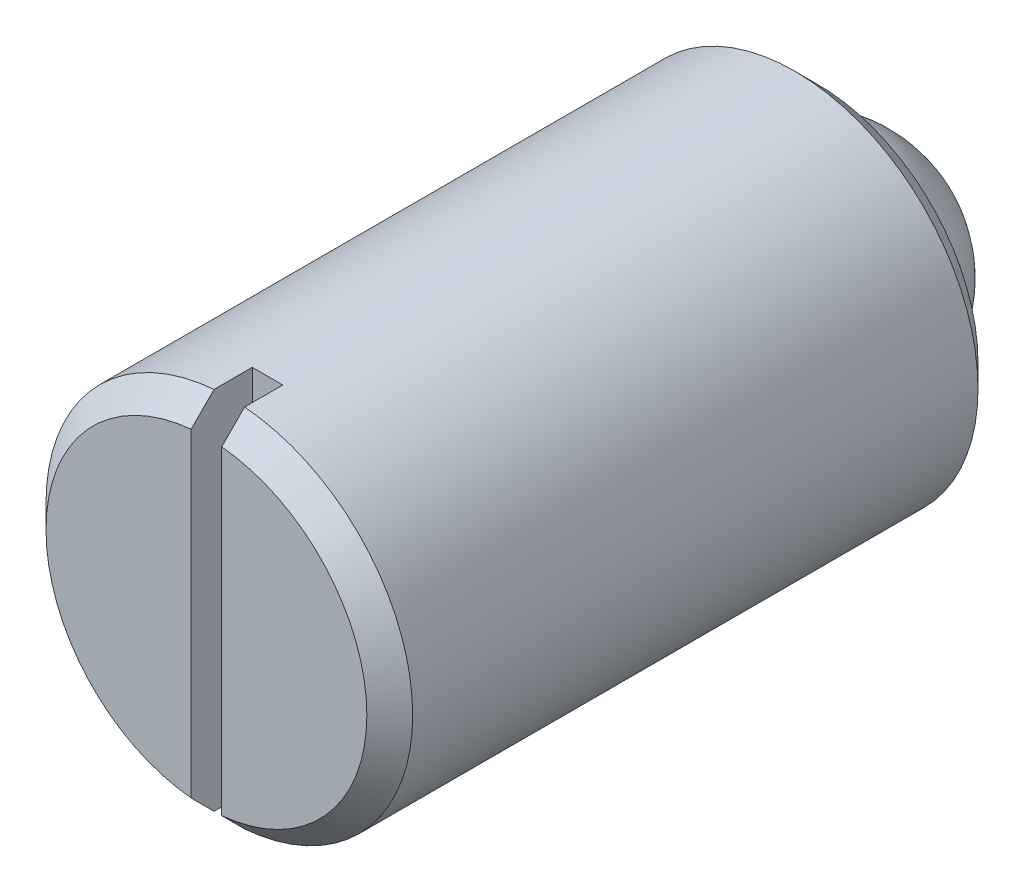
ISO-10303-21;
HEADER;
FILE_DESCRIPTION(('STEP AP214'),'2;1');
FILE_NAME('part.step','',(''),(''),'','','');
FILE_SCHEMA(('AUTOMOTIVE_DESIGN { 1 0 10303 214 1 1 1 1 }'));
ENDSEC;
DATA;
#1=APPLICATION_CONTEXT('core data for automotive mechanical design processes');
#2=APPLICATION_PROTOCOL_DEFINITION('international standard','automotive_design',2000,#1);
#3=PRODUCT_CONTEXT('',#1,'mechanical');
#4=PRODUCT('Part','Part','',(#3));
#5=PRODUCT_RELATED_PRODUCT_CATEGORY('part','',(#4));
#6=PRODUCT_DEFINITION_FORMATION('','',#4);
#7=PRODUCT_DEFINITION_CONTEXT('part definition',#1,'design');
#8=PRODUCT_DEFINITION('design','',#6,#7);
#9=PRODUCT_DEFINITION_SHAPE('','',#8);
#10=(LENGTH_UNIT() NAMED_UNIT(*) SI_UNIT(.MILLI.,.METRE.));
#11=(NAMED_UNIT(*) PLANE_ANGLE_UNIT() SI_UNIT($,.RADIAN.));
#12=(NAMED_UNIT(*) SI_UNIT($,.STERADIAN.) SOLID_ANGLE_UNIT());
#13=UNCERTAINTY_MEASURE_WITH_UNIT(LENGTH_MEASURE(1.E-05),#10,'distance_accuracy_value','');
#14=(GEOMETRIC_REPRESENTATION_CONTEXT(3) GLOBAL_UNCERTAINTY_ASSIGNED_CONTEXT((#13)) GLOBAL_UNIT_ASSIGNED_CONTEXT((#10,
#11,#12)) REPRESENTATION_CONTEXT('',''));
#15=CARTESIAN_POINT('',(0.,0.,0.));
#16=DIRECTION('',(0.,0.,1.));
#17=DIRECTION('',(1.,0.,0.));
#18=AXIS2_PLACEMENT_3D('',#15,#16,#17);
#19=CARTESIAN_POINT('',(0.,0.,0.));
#20=DIRECTION('',(0.,0.,1.));
#21=DIRECTION('',(1.,0.,0.));
#22=AXIS2_PLACEMENT_3D('',#19,#20,#21);
#23=PLANE('',#22);
#24=CARTESIAN_POINT('',(0.,0.,0.));
#25=DIRECTION('',(0.,0.,1.));
#26=DIRECTION('',(1.,0.,0.));
#27=AXIS2_PLACEMENT_3D('',#24,#25,#26);
#28=CIRCLE('',#27,5.25);
#29=CARTESIAN_POINT('',(5.25,0.,0.));
#30=VERTEX_POINT('',#29);
#31=EDGE_CURVE('E110',#30,#30,#28,.F.);
#32=ORIENTED_EDGE('',*,*,#31,.T.);
#33=EDGE_LOOP('',(#32));
#34=FACE_BOUND('',#33,.T.);
#35=CARTESIAN_POINT('',(0.,0.,0.));
#36=DIRECTION('',(0.,0.,1.));
#37=DIRECTION('',(1.,0.,0.));
#38=AXIS2_PLACEMENT_3D('',#35,#36,#37);
#39=CIRCLE('',#38,3.96862696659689);
#40=CARTESIAN_POINT('',(3.96862696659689,0.,0.));
#41=VERTEX_POINT('',#40);
#42=EDGE_CURVE('E11',#41,#41,#39,.F.);
#43=ORIENTED_EDGE('',*,*,#42,.F.);
#44=EDGE_LOOP('',(#43));
#45=FACE_BOUND('',#44,.T.);
#46=ADVANCED_FACE('F32',(#34,#45),#23,.F.);
#47=CARTESIAN_POINT('',(0.,0.,20.));
#48=DIRECTION('',(0.,0.,1.));
#49=DIRECTION('',(1.,0.,0.));
#50=AXIS2_PLACEMENT_3D('',#47,#48,#49);
#51=PLANE('',#50);
#52=DIRECTION('',(0.,-1.,0.));
#53=VECTOR('',#52,1.);
#54=CARTESIAN_POINT('',(-0.5,-5.9791303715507,20.));
#55=LINE('',#54,#53);
#56=CARTESIAN_POINT('',(-0.5,5.22613624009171,20.));
#57=VERTEX_POINT('',#56);
#58=CARTESIAN_POINT('',(-0.5,-5.22613624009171,20.));
#59=VERTEX_POINT('',#58);
#60=EDGE_CURVE('E84',#57,#59,#55,.T.);
#61=ORIENTED_EDGE('',*,*,#60,.F.);
#62=CARTESIAN_POINT('',(0.,0.,20.));
#63=DIRECTION('',(0.,0.,1.));
#64=DIRECTION('',(1.,0.,0.));
#65=AXIS2_PLACEMENT_3D('',#62,#63,#64);
#66=CIRCLE('',#65,5.25);
#67=EDGE_CURVE('E96',#57,#59,#66,.T.);
#68=ORIENTED_EDGE('',*,*,#67,.T.);
#69=EDGE_LOOP('',(#61,#68));
#70=FACE_BOUND('',#69,.T.);
#71=ADVANCED_FACE('F95',(#70),#51,.T.);
#72=CARTESIAN_POINT('',(0.,0.,20.));
#73=DIRECTION('',(0.,0.,-1.));
#74=DIRECTION('',(-1.,0.,0.));
#75=AXIS2_PLACEMENT_3D('',#72,#73,#74);
#76=CONICAL_SURFACE('',#75,5.25,0.785398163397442);
#77=CARTESIAN_POINT('',(-0.5,9.92785552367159,15.3095616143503));
#78=CARTESIAN_POINT('',(-0.5,9.55208986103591,15.684845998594));
#79=CARTESIAN_POINT('',(-0.5,9.17630246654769,16.0601086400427));
#80=CARTESIAN_POINT('',(-0.5,8.42465346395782,16.8105507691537));
#81=CARTESIAN_POINT('',(-0.5,8.04879185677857,17.1857302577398));
#82=CARTESIAN_POINT('',(-0.5,7.29696704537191,17.9359630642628));
#83=CARTESIAN_POINT('',(-0.5,6.92100384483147,18.3110163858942));
#84=CARTESIAN_POINT('',(-0.5,6.16889213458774,19.0609458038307));
#85=CARTESIAN_POINT('',(-0.5,5.79274362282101,19.4358218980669));
#86=CARTESIAN_POINT('',(-0.5,5.22826724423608,19.9979065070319));
#87=CARTESIAN_POINT('',(-0.5,5.04005989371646,20.1852360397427));
#88=CARTESIAN_POINT('',(-0.5,4.66353260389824,20.559780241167));
#89=CARTESIAN_POINT('',(-0.5,4.47521266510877,20.7469949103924));
#90=CARTESIAN_POINT('',(-0.5,4.09841687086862,21.1212541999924));
#91=CARTESIAN_POINT('',(-0.5,3.90994102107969,21.3082988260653));
#92=CARTESIAN_POINT('',(-0.5,3.53273897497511,21.6821415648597));
#93=CARTESIAN_POINT('',(-0.5,3.34401277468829,21.8689396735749));
#94=CARTESIAN_POINT('',(-0.5,2.96614271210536,22.2421588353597));
#95=CARTESIAN_POINT('',(-0.5,2.77699880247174,22.4285798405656));
#96=CARTESIAN_POINT('',(-0.5,2.49275132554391,22.707659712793));
#97=CARTESIAN_POINT('',(-0.5,2.39791616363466,22.8005918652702));
#98=CARTESIAN_POINT('',(-0.5,2.20798895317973,22.9861967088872));
#99=CARTESIAN_POINT('',(-0.5,2.11289690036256,23.0788693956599));
#100=CARTESIAN_POINT('',(-0.5,1.92232227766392,23.2638485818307));
#101=CARTESIAN_POINT('',(-0.5,1.82683963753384,23.3561550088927));
#102=CARTESIAN_POINT('',(-0.5,1.63530782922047,23.5401711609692));
#103=CARTESIAN_POINT('',(-0.5,1.53925868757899,23.6318809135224));
#104=CARTESIAN_POINT('',(-0.5,1.39445591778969,23.7686960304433));
#105=CARTESIAN_POINT('',(-0.5,1.34606145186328,23.814181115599));
#106=CARTESIAN_POINT('',(-0.5,1.24894665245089,23.9047998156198));
#107=CARTESIAN_POINT('',(-0.5,1.20022632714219,23.9499334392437));
#108=CARTESIAN_POINT('',(-0.5,1.10233613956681,24.0397291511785));
#109=CARTESIAN_POINT('',(-0.5,1.05316620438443,24.0843911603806));
#110=CARTESIAN_POINT('',(-0.5,0.954163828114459,24.1729822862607));
#111=CARTESIAN_POINT('',(-0.5,0.904331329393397,24.2169113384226));
#112=CARTESIAN_POINT('',(-0.5,0.854061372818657,24.2603430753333));
#113=B_SPLINE_CURVE_WITH_KNOTS('',3,(#77,#78,#79,#80,#81,#82,#83,#84,#85,#86,#87,#88,#89,#90,
#91,#92,#93,#94,#95,#96,#97,#98,#99,#100,#101,#102,#103,#104,#105,#106,#107,#108,#109,#110,#111,
#112),.UNSPECIFIED.,.F.,.F.,(4,2,2,2,2,2,2,2,2,2,2,2,2,2,2,2,2,4),(0.,1.59321808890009,
3.18641748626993,4.77956525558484,6.37273118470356,7.16936735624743,7.96599995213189,
8.76260478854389,9.55922241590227,10.355935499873,10.75427026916,11.1526117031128,
11.5510282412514,11.9494262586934,12.1486691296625,12.3479070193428,12.5471778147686,
12.7464660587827),.UNSPECIFIED.);
#114=CARTESIAN_POINT('',(-0.5,5.9791303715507,19.25));
#115=VERTEX_POINT('',#114);
#116=EDGE_CURVE('E81',#115,#57,#113,.T.);
#117=ORIENTED_EDGE('',*,*,#116,.F.);
#118=CARTESIAN_POINT('',(0.,0.,19.25));
#119=DIRECTION('',(0.,0.,1.));
#120=DIRECTION('',(1.,0.,0.));
#121=AXIS2_PLACEMENT_3D('',#118,#119,#120);
#122=CIRCLE('',#121,6.);
#123=CARTESIAN_POINT('',(-0.5,-5.9791303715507,19.25));
#124=VERTEX_POINT('',#123);
#125=EDGE_CURVE('E119',#124,#115,#122,.F.);
#126=ORIENTED_EDGE('',*,*,#125,.F.);
#127=CARTESIAN_POINT('',(-0.5,-0.854061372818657,24.2603430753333));
#128=CARTESIAN_POINT('',(-0.5,-0.890663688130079,24.2287410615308));
#129=CARTESIAN_POINT('',(-0.5,-0.927023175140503,24.1968613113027));
#130=CARTESIAN_POINT('',(-0.5,-0.999355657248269,24.1326697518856));
#131=CARTESIAN_POINT('',(-0.5,-1.03532867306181,24.1003579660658));
#132=CARTESIAN_POINT('',(-0.5,-1.14281242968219,24.0029637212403));
#133=CARTESIAN_POINT('',(-0.5,-1.21389822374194,23.937413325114));
#134=CARTESIAN_POINT('',(-0.5,-1.35535946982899,23.8055801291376));
#135=CARTESIAN_POINT('',(-0.5,-1.42573505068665,23.7392974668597));
#136=CARTESIAN_POINT('',(-0.5,-1.56602555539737,23.6062403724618));
#137=CARTESIAN_POINT('',(-0.5,-1.63594045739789,23.5394659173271));
#138=CARTESIAN_POINT('',(-0.5,-1.84513158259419,23.3387312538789));
#139=CARTESIAN_POINT('',(-0.5,-1.98393738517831,23.2042814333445));
#140=CARTESIAN_POINT('',(-0.5,-2.2608834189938,22.9346976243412));
#141=CARTESIAN_POINT('',(-0.5,-2.39902364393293,22.799563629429));
#142=CARTESIAN_POINT('',(-0.5,-2.81285574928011,22.3935636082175));
#143=CARTESIAN_POINT('',(-0.5,-3.08795984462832,22.1220987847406));
#144=CARTESIAN_POINT('',(-0.5,-3.63755330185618,21.5784507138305));
#145=CARTESIAN_POINT('',(-0.5,-3.91204254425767,21.3062673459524));
#146=CARTESIAN_POINT('',(-0.5,-4.460651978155,20.7615316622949));
#147=CARTESIAN_POINT('',(-0.5,-4.73477217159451,20.4889793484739));
#148=CARTESIAN_POINT('',(-0.5,-5.07674086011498,20.14870069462));
#149=CARTESIAN_POINT('',(-0.5,-5.14468943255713,20.0810748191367));
#150=CARTESIAN_POINT('',(-0.5,-5.28057188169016,19.9458132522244));
#151=CARTESIAN_POINT('',(-0.5,-5.34850575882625,19.8781775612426));
#152=CARTESIAN_POINT('',(-0.5,-5.79270269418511,19.4358620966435));
#153=CARTESIAN_POINT('',(-0.5,-6.16881079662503,19.0610267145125));
#154=CARTESIAN_POINT('',(-0.5,-6.92084581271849,18.3111741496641));
#155=CARTESIAN_POINT('',(-0.5,-7.29677272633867,17.9361569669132));
#156=CARTESIAN_POINT('',(-0.5,-8.04860198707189,17.1859197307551));
#157=CARTESIAN_POINT('',(-0.5,-8.42450430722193,16.8106996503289));
#158=CARTESIAN_POINT('',(-0.5,-9.17623018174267,16.0601808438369));
#159=CARTESIAN_POINT('',(-0.5,-9.55205373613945,15.6848821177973));
#160=CARTESIAN_POINT('',(-0.5,-9.92785552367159,15.3095616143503));
#161=B_SPLINE_CURVE_WITH_KNOTS('',3,(#127,#128,#129,#130,#131,#132,#133,#134,#135,#136,#137,
#138,#139,#140,#141,#142,#143,#144,#145,#146,#147,#148,#149,#150,#151,#152,#153,#154,#155,#156,
#157,#158,#159,#160),.UNSPECIFIED.,.F.,.F.,(4,2,2,2,2,2,2,2,2,2,2,2,2,2,2,2,4),(0.,
0.145066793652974,0.290125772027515,0.580202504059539,0.870225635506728,1.16026242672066,
1.73999333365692,2.31972971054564,3.47919918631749,4.63887722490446,5.79854913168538,
6.0861467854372,6.3737339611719,7.96672780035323,9.55972193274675,11.153093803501,
12.7464651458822),.UNSPECIFIED.);
#162=EDGE_CURVE('E100',#59,#124,#161,.T.);
#163=ORIENTED_EDGE('',*,*,#162,.F.);
#164=ORIENTED_EDGE('',*,*,#67,.F.);
#165=EDGE_LOOP('',(#117,#126,#163,#164));
#166=FACE_BOUND('',#165,.T.);
#167=ADVANCED_FACE('F99',(#166),#76,.T.);
#168=CARTESIAN_POINT('',(0.5,0.854061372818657,24.2603430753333));
#169=CARTESIAN_POINT('',(0.5,0.890663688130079,24.2287410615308));
#170=CARTESIAN_POINT('',(0.5,0.927023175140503,24.1968613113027));
#171=CARTESIAN_POINT('',(0.5,0.999355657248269,24.1326697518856));
#172=CARTESIAN_POINT('',(0.5,1.03532867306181,24.1003579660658));
#173=CARTESIAN_POINT('',(0.5,1.14281242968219,24.0029637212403));
#174=CARTESIAN_POINT('',(0.5,1.21389822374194,23.937413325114));
#175=CARTESIAN_POINT('',(0.5,1.35535946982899,23.8055801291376));
#176=CARTESIAN_POINT('',(0.5,1.42573505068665,23.7392974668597));
#177=CARTESIAN_POINT('',(0.5,1.56602555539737,23.6062403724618));
#178=CARTESIAN_POINT('',(0.5,1.63594045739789,23.5394659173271));
#179=CARTESIAN_POINT('',(0.5,1.84513158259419,23.3387312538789));
#180=CARTESIAN_POINT('',(0.5,1.98393738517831,23.2042814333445));
#181=CARTESIAN_POINT('',(0.5,2.2608834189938,22.9346976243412));
#182=CARTESIAN_POINT('',(0.5,2.39902364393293,22.799563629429));
#183=CARTESIAN_POINT('',(0.5,2.81285574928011,22.3935636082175));
#184=CARTESIAN_POINT('',(0.5,3.08795984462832,22.1220987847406));
#185=CARTESIAN_POINT('',(0.5,3.63755330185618,21.5784507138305));
#186=CARTESIAN_POINT('',(0.5,3.91204254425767,21.3062673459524));
#187=CARTESIAN_POINT('',(0.5,4.460651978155,20.7615316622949));
#188=CARTESIAN_POINT('',(0.5,4.73477217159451,20.4889793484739));
#189=CARTESIAN_POINT('',(0.5,5.07674086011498,20.14870069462));
#190=CARTESIAN_POINT('',(0.5,5.14468943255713,20.0810748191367));
#191=CARTESIAN_POINT('',(0.5,5.28057188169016,19.9458132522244));
#192=CARTESIAN_POINT('',(0.5,5.34850575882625,19.8781775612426));
#193=CARTESIAN_POINT('',(0.5,5.79270269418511,19.4358620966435));
#194=CARTESIAN_POINT('',(0.5,6.16881079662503,19.0610267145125));
#195=CARTESIAN_POINT('',(0.5,6.92084581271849,18.3111741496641));
#196=CARTESIAN_POINT('',(0.5,7.29677272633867,17.9361569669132));
#197=CARTESIAN_POINT('',(0.5,8.04860198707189,17.1859197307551));
#198=CARTESIAN_POINT('',(0.5,8.42450430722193,16.8106996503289));
#199=CARTESIAN_POINT('',(0.5,9.17623018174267,16.0601808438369));
#200=CARTESIAN_POINT('',(0.5,9.55205373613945,15.6848821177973));
#201=CARTESIAN_POINT('',(0.5,9.92785552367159,15.3095616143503));
#202=B_SPLINE_CURVE_WITH_KNOTS('',3,(#168,#169,#170,#171,#172,#173,#174,#175,#176,#177,#178,
#179,#180,#181,#182,#183,#184,#185,#186,#187,#188,#189,#190,#191,#192,#193,#194,#195,#196,#197,
#198,#199,#200,#201),.UNSPECIFIED.,.F.,.F.,(4,2,2,2,2,2,2,2,2,2,2,2,2,2,2,2,4),(0.,
0.145066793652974,0.290125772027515,0.580202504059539,0.870225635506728,1.16026242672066,
1.73999333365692,2.31972971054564,3.47919918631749,4.63887722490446,5.79854913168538,
6.0861467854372,6.3737339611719,7.96672780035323,9.55972193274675,11.153093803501,
12.7464651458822),.UNSPECIFIED.);
#203=CARTESIAN_POINT('',(0.5,5.22613624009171,20.));
#204=VERTEX_POINT('',#203);
#205=CARTESIAN_POINT('',(0.5,5.9791303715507,19.25));
#206=VERTEX_POINT('',#205);
#207=EDGE_CURVE('E148',#204,#206,#202,.T.);
#208=ORIENTED_EDGE('',*,*,#207,.F.);
#209=CARTESIAN_POINT('',(0.5,-5.22613624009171,20.));
#210=VERTEX_POINT('',#209);
#211=EDGE_CURVE('E103',#210,#204,#66,.T.);
#212=ORIENTED_EDGE('',*,*,#211,.F.);
#213=CARTESIAN_POINT('',(0.5,-9.92785552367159,15.3095616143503));
#214=CARTESIAN_POINT('',(0.5,-9.55208986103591,15.684845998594));
#215=CARTESIAN_POINT('',(0.5,-9.17630246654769,16.0601086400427));
#216=CARTESIAN_POINT('',(0.5,-8.42465346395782,16.8105507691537));
#217=CARTESIAN_POINT('',(0.5,-8.04879185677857,17.1857302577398));
#218=CARTESIAN_POINT('',(0.5,-7.29696704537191,17.9359630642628));
#219=CARTESIAN_POINT('',(0.5,-6.92100384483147,18.3110163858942));
#220=CARTESIAN_POINT('',(0.5,-6.16889213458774,19.0609458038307));
#221=CARTESIAN_POINT('',(0.5,-5.79274362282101,19.4358218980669));
#222=CARTESIAN_POINT('',(0.5,-5.22826724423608,19.9979065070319));
#223=CARTESIAN_POINT('',(0.5,-5.04005989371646,20.1852360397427));
#224=CARTESIAN_POINT('',(0.5,-4.66353260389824,20.559780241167));
#225=CARTESIAN_POINT('',(0.5,-4.47521266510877,20.7469949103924));
#226=CARTESIAN_POINT('',(0.5,-4.09841687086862,21.1212541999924));
#227=CARTESIAN_POINT('',(0.5,-3.90994102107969,21.3082988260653));
#228=CARTESIAN_POINT('',(0.5,-3.53273897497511,21.6821415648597));
#229=CARTESIAN_POINT('',(0.5,-3.34401277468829,21.8689396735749));
#230=CARTESIAN_POINT('',(0.5,-2.96614271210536,22.2421588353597));
#231=CARTESIAN_POINT('',(0.5,-2.77699880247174,22.4285798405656));
#232=CARTESIAN_POINT('',(0.5,-2.49275132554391,22.707659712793));
#233=CARTESIAN_POINT('',(0.5,-2.39791616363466,22.8005918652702));
#234=CARTESIAN_POINT('',(0.5,-2.20798895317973,22.9861967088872));
#235=CARTESIAN_POINT('',(0.5,-2.11289690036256,23.0788693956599));
#236=CARTESIAN_POINT('',(0.5,-1.92232227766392,23.2638485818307));
#237=CARTESIAN_POINT('',(0.5,-1.82683963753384,23.3561550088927));
#238=CARTESIAN_POINT('',(0.5,-1.63530782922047,23.5401711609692));
#239=CARTESIAN_POINT('',(0.5,-1.53925868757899,23.6318809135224));
#240=CARTESIAN_POINT('',(0.5,-1.39445591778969,23.7686960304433));
#241=CARTESIAN_POINT('',(0.5,-1.34606145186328,23.814181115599));
#242=CARTESIAN_POINT('',(0.5,-1.24894665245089,23.9047998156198));
#243=CARTESIAN_POINT('',(0.5,-1.20022632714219,23.9499334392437));
#244=CARTESIAN_POINT('',(0.5,-1.10233613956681,24.0397291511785));
#245=CARTESIAN_POINT('',(0.5,-1.05316620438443,24.0843911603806));
#246=CARTESIAN_POINT('',(0.5,-0.954163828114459,24.1729822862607));
#247=CARTESIAN_POINT('',(0.5,-0.904331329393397,24.2169113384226));
#248=CARTESIAN_POINT('',(0.5,-0.854061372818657,24.2603430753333));
#249=B_SPLINE_CURVE_WITH_KNOTS('',3,(#213,#214,#215,#216,#217,#218,#219,#220,#221,#222,#223,
#224,#225,#226,#227,#228,#229,#230,#231,#232,#233,#234,#235,#236,#237,#238,#239,#240,#241,#242,
#243,#244,#245,#246,#247,#248),.UNSPECIFIED.,.F.,.F.,(4,2,2,2,2,2,2,2,2,2,2,2,2,2,2,2,2,4),(0.,
1.59321808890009,3.18641748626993,4.77956525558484,6.37273118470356,7.16936735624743,
7.96599995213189,8.76260478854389,9.55922241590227,10.355935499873,10.75427026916,
11.1526117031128,11.5510282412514,11.9494262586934,12.1486691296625,12.3479070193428,
12.5471778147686,12.7464660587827),.UNSPECIFIED.);
#250=CARTESIAN_POINT('',(0.5,-5.9791303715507,19.25));
#251=VERTEX_POINT('',#250);
#252=EDGE_CURVE('E116',#251,#210,#249,.T.);
#253=ORIENTED_EDGE('',*,*,#252,.F.);
#254=EDGE_CURVE('E105',#206,#251,#122,.F.);
#255=ORIENTED_EDGE('',*,*,#254,.F.);
#256=EDGE_LOOP('',(#208,#212,#253,#255));
#257=FACE_BOUND('',#256,.T.);
#258=ADVANCED_FACE('F135',(#257),#76,.T.);
#259=CARTESIAN_POINT('',(0.,0.,20.));
#260=DIRECTION('',(0.,0.,-1.));
#261=DIRECTION('',(-1.,0.,0.));
#262=AXIS2_PLACEMENT_3D('',#259,#260,#261);
#263=CYLINDRICAL_SURFACE('',#262,6.);
#264=CARTESIAN_POINT('',(0.5,5.9791303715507,18.));
#265=DIRECTION('',(-1.,0.,0.));
#266=VECTOR('',#265,1.);
#267=LINE('',#264,#266);
#268=CARTESIAN_POINT('',(0.5,5.9791303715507,18.));
#269=VERTEX_POINT('',#268);
#270=CARTESIAN_POINT('',(-0.5,5.9791303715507,18.));
#271=VERTEX_POINT('',#270);
#272=EDGE_CURVE('E42',#269,#271,#267,.T.);
#273=ORIENTED_EDGE('',*,*,#272,.F.);
#274=DIRECTION('',(0.,0.,-1.));
#275=VECTOR('',#274,1.);
#276=CARTESIAN_POINT('',(0.5,5.9791303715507,20.));
#277=LINE('',#276,#275);
#278=EDGE_CURVE('E101',#269,#206,#277,.F.);
#279=ORIENTED_EDGE('',*,*,#278,.T.);
#280=ORIENTED_EDGE('',*,*,#254,.T.);
#281=DIRECTION('',(0.,0.,1.));
#282=VECTOR('',#281,1.);
#283=CARTESIAN_POINT('',(0.5,-5.9791303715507,18.));
#284=LINE('',#283,#282);
#285=CARTESIAN_POINT('',(0.5,-5.9791303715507,18.));
#286=VERTEX_POINT('',#285);
#287=EDGE_CURVE('E152',#286,#251,#284,.T.);
#288=ORIENTED_EDGE('',*,*,#287,.F.);
#289=CARTESIAN_POINT('',(-0.5,-5.9791303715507,18.));
#290=DIRECTION('',(1.,0.,0.));
#291=VECTOR('',#290,1.);
#292=LINE('',#289,#291);
#293=CARTESIAN_POINT('',(-0.5,-5.9791303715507,18.));
#294=VERTEX_POINT('',#293);
#295=EDGE_CURVE('E162',#294,#286,#292,.T.);
#296=ORIENTED_EDGE('',*,*,#295,.F.);
#297=DIRECTION('',(0.,0.,1.));
#298=VECTOR('',#297,1.);
#299=CARTESIAN_POINT('',(-0.5,-5.9791303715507,18.));
#300=LINE('',#299,#298);
#301=EDGE_CURVE('E122',#294,#124,#300,.T.);
#302=ORIENTED_EDGE('',*,*,#301,.T.);
#303=ORIENTED_EDGE('',*,*,#125,.T.);
#304=DIRECTION('',(0.,0.,-1.));
#305=VECTOR('',#304,1.);
#306=CARTESIAN_POINT('',(-0.500000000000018,5.9791303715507,20.));
#307=LINE('',#306,#305);
#308=EDGE_CURVE('E87',#271,#115,#307,.F.);
#309=ORIENTED_EDGE('',*,*,#308,.F.);
#310=EDGE_LOOP('',(#273,#279,#280,#288,#296,#302,#303,#309));
#311=FACE_BOUND('',#310,.T.);
#312=CARTESIAN_POINT('',(0.,0.,0.750000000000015));
#313=DIRECTION('',(0.,0.,1.));
#314=DIRECTION('',(1.,0.,0.));
#315=AXIS2_PLACEMENT_3D('',#312,#313,#314);
#316=CIRCLE('',#315,6.);
#317=CARTESIAN_POINT('',(6.,0.,0.750000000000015));
#318=VERTEX_POINT('',#317);
#319=EDGE_CURVE('E111',#318,#318,#316,.T.);
#320=ORIENTED_EDGE('',*,*,#319,.T.);
#321=EDGE_LOOP('',(#320));
#322=FACE_BOUND('',#321,.T.);
#323=ADVANCED_FACE('F34',(#311,#322),#263,.T.);
#324=DIRECTION('',(0.,1.,0.));
#325=VECTOR('',#324,1.);
#326=CARTESIAN_POINT('',(0.5,-5.9791303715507,20.));
#327=LINE('',#326,#325);
#328=EDGE_CURVE('E129',#210,#204,#327,.T.);
#329=ORIENTED_EDGE('',*,*,#328,.F.);
#330=ORIENTED_EDGE('',*,*,#211,.T.);
#331=EDGE_LOOP('',(#329,#330));
#332=FACE_BOUND('',#331,.T.);
#333=ADVANCED_FACE('F214',(#332),#51,.T.);
#334=CARTESIAN_POINT('',(0.,0.,0.750000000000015));
#335=DIRECTION('',(0.,0.,1.));
#336=DIRECTION('',(1.,0.,0.));
#337=AXIS2_PLACEMENT_3D('',#334,#335,#336);
#338=CONICAL_SURFACE('',#337,6.,0.785398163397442);
#339=ORIENTED_EDGE('',*,*,#31,.F.);
#340=EDGE_LOOP('',(#339));
#341=FACE_BOUND('',#340,.T.);
#342=ORIENTED_EDGE('',*,*,#319,.F.);
#343=EDGE_LOOP('',(#342));
#344=FACE_BOUND('',#343,.T.);
#345=ADVANCED_FACE('F141',(#341,#344),#338,.T.);
#346=CARTESIAN_POINT('',(0.5,-5.9791303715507,18.));
#347=DIRECTION('',(1.,0.,0.));
#348=DIRECTION('',(0.,0.,-1.));
#349=AXIS2_PLACEMENT_3D('',#346,#347,#348);
#350=PLANE('',#349);
#351=ORIENTED_EDGE('',*,*,#252,.T.);
#352=ORIENTED_EDGE('',*,*,#328,.T.);
#353=ORIENTED_EDGE('',*,*,#207,.T.);
#354=ORIENTED_EDGE('',*,*,#278,.F.);
#355=DIRECTION('',(0.,1.,0.));
#356=VECTOR('',#355,1.);
#357=CARTESIAN_POINT('',(0.5,-5.9791303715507,18.));
#358=LINE('',#357,#356);
#359=EDGE_CURVE('E50',#286,#269,#358,.T.);
#360=ORIENTED_EDGE('',*,*,#359,.F.);
#361=ORIENTED_EDGE('',*,*,#287,.T.);
#362=EDGE_LOOP('',(#351,#352,#353,#354,#360,#361));
#363=FACE_BOUND('',#362,.T.);
#364=ADVANCED_FACE('F138',(#363),#350,.F.);
#365=CARTESIAN_POINT('',(-0.5,-5.9791303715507,18.));
#366=DIRECTION('',(-1.,0.,0.));
#367=DIRECTION('',(0.,0.,1.));
#368=AXIS2_PLACEMENT_3D('',#365,#366,#367);
#369=PLANE('',#368);
#370=ORIENTED_EDGE('',*,*,#162,.T.);
#371=ORIENTED_EDGE('',*,*,#301,.F.);
#372=DIRECTION('',(0.,-1.,0.));
#373=VECTOR('',#372,1.);
#374=CARTESIAN_POINT('',(-0.5,-5.9791303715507,18.));
#375=LINE('',#374,#373);
#376=EDGE_CURVE('E97',#271,#294,#375,.T.);
#377=ORIENTED_EDGE('',*,*,#376,.F.);
#378=ORIENTED_EDGE('',*,*,#308,.T.);
#379=ORIENTED_EDGE('',*,*,#116,.T.);
#380=ORIENTED_EDGE('',*,*,#60,.T.);
#381=EDGE_LOOP('',(#370,#371,#377,#378,#379,#380));
#382=FACE_BOUND('',#381,.T.);
#383=ADVANCED_FACE('F83',(#382),#369,.F.);
#384=CARTESIAN_POINT('',(-0.5,-5.9791303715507,18.));
#385=DIRECTION('',(0.,0.,-1.));
#386=DIRECTION('',(-1.,0.,0.));
#387=AXIS2_PLACEMENT_3D('',#384,#385,#386);
#388=PLANE('',#387);
#389=ORIENTED_EDGE('',*,*,#376,.T.);
#390=ORIENTED_EDGE('',*,*,#295,.T.);
#391=ORIENTED_EDGE('',*,*,#359,.T.);
#392=ORIENTED_EDGE('',*,*,#272,.T.);
#393=EDGE_LOOP('',(#389,#390,#391,#392));
#394=FACE_BOUND('',#393,.T.);
#395=ADVANCED_FACE('F145',(#394),#388,.F.);
#396=CARTESIAN_POINT('',(0.,0.,0.5));
#397=DIRECTION('',(0.,0.,-1.));
#398=DIRECTION('',(1.,0.,0.));
#399=AXIS2_PLACEMENT_3D('',#396,#397,#398);
#400=SPHERICAL_SURFACE('',#399,4.);
#401=ORIENTED_EDGE('',*,*,#42,.T.);
#402=EDGE_LOOP('',(#401));
#403=FACE_BOUND('',#402,.T.);
#404=ADVANCED_FACE('F251',(#403),#400,.T.);
#405=CLOSED_SHELL('',(#46,#71,#167,#258,#323,#333,#345,#364,#383,#395,#404));
#406=MANIFOLD_SOLID_BREP('B2',#405);
#407=ADVANCED_BREP_SHAPE_REPRESENTATION('',(#18,#406),#14);
#408=SHAPE_DEFINITION_REPRESENTATION(#9,#407);
ENDSEC;
END-ISO-10303-21;
